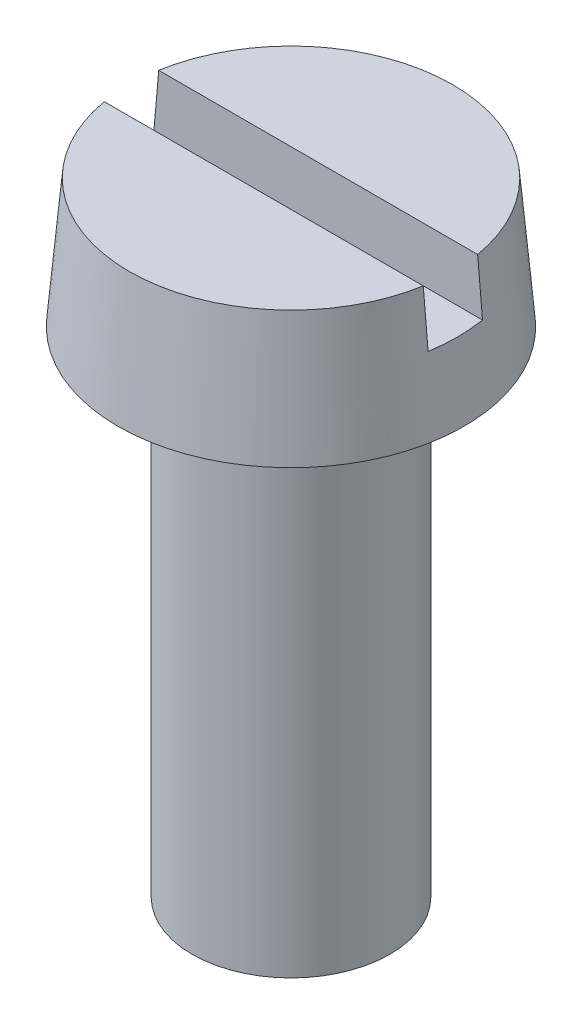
ISO-10303-21;
HEADER;
FILE_DESCRIPTION(('STEP AP214'),'2;1');
FILE_NAME('part.step','',(''),(''),'','','');
FILE_SCHEMA(('AUTOMOTIVE_DESIGN { 1 0 10303 214 1 1 1 1 }'));
ENDSEC;
DATA;
#1=APPLICATION_CONTEXT('core data for automotive mechanical design processes');
#2=APPLICATION_PROTOCOL_DEFINITION('international standard','automotive_design',2000,#1);
#3=PRODUCT_CONTEXT('',#1,'mechanical');
#4=PRODUCT('Part','Part','',(#3));
#5=PRODUCT_RELATED_PRODUCT_CATEGORY('part','',(#4));
#6=PRODUCT_DEFINITION_FORMATION('','',#4);
#7=PRODUCT_DEFINITION_CONTEXT('part definition',#1,'design');
#8=PRODUCT_DEFINITION('design','',#6,#7);
#9=PRODUCT_DEFINITION_SHAPE('','',#8);
#10=(LENGTH_UNIT() NAMED_UNIT(*) SI_UNIT(.MILLI.,.METRE.));
#11=(NAMED_UNIT(*) PLANE_ANGLE_UNIT() SI_UNIT($,.RADIAN.));
#12=(NAMED_UNIT(*) SI_UNIT($,.STERADIAN.) SOLID_ANGLE_UNIT());
#13=UNCERTAINTY_MEASURE_WITH_UNIT(LENGTH_MEASURE(1.E-05),#10,'distance_accuracy_value','');
#14=(GEOMETRIC_REPRESENTATION_CONTEXT(3) GLOBAL_UNCERTAINTY_ASSIGNED_CONTEXT((#13)) GLOBAL_UNIT_ASSIGNED_CONTEXT((#10,
#11,#12)) REPRESENTATION_CONTEXT('',''));
#15=CARTESIAN_POINT('',(0.,0.,0.));
#16=DIRECTION('',(0.,0.,1.));
#17=DIRECTION('',(1.,0.,0.));
#18=AXIS2_PLACEMENT_3D('',#15,#16,#17);
#19=CARTESIAN_POINT('',(4.19999999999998,1.5,0.550000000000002));
#20=DIRECTION('',(0.,-1.,0.));
#21=DIRECTION('',(1.,0.,0.));
#22=AXIS2_PLACEMENT_3D('',#19,#20,#21);
#23=PLANE('',#22);
#24=CARTESIAN_POINT('',(0.,1.50000000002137,0.));
#25=DIRECTION('',(0.,-1.,0.));
#26=DIRECTION('',(0.,0.,-1.));
#27=AXIS2_PLACEMENT_3D('',#24,#25,#26);
#28=CIRCLE('',#27,3.36876700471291);
#29=CARTESIAN_POINT('',(-3.32356602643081,1.50000000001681,0.550000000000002));
#30=VERTEX_POINT('',#29);
#31=CARTESIAN_POINT('',(-3.32356602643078,1.50000000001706,-0.550000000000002));
#32=VERTEX_POINT('',#31);
#33=EDGE_CURVE('E70',#30,#32,#28,.T.);
#34=ORIENTED_EDGE('',*,*,#33,.F.);
#35=DIRECTION('',(1.,0.,0.));
#36=VECTOR('',#35,1.);
#37=CARTESIAN_POINT('',(4.19999999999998,1.50000000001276,0.550000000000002));
#38=LINE('',#37,#36);
#39=CARTESIAN_POINT('',(3.32356602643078,1.50000000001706,0.550000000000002));
#40=VERTEX_POINT('',#39);
#41=EDGE_CURVE('E68',#30,#40,#38,.T.);
#42=ORIENTED_EDGE('',*,*,#41,.T.);
#43=CARTESIAN_POINT('',(0.,1.50000000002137,0.));
#44=DIRECTION('',(0.,-1.,0.));
#45=DIRECTION('',(0.,0.,-1.));
#46=AXIS2_PLACEMENT_3D('',#43,#44,#45);
#47=CIRCLE('',#46,3.36876700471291);
#48=CARTESIAN_POINT('',(3.3235660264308,1.50000000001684,-0.550000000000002));
#49=VERTEX_POINT('',#48);
#50=EDGE_CURVE('E19',#49,#40,#47,.T.);
#51=ORIENTED_EDGE('',*,*,#50,.F.);
#52=DIRECTION('',(-1.,0.,0.));
#53=VECTOR('',#52,1.);
#54=CARTESIAN_POINT('',(4.19999999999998,1.50000000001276,-0.550000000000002));
#55=LINE('',#54,#53);
#56=EDGE_CURVE('E63',#49,#32,#55,.T.);
#57=ORIENTED_EDGE('',*,*,#56,.T.);
#58=EDGE_LOOP('',(#34,#42,#51,#57));
#59=FACE_BOUND('',#58,.T.);
#60=ADVANCED_FACE('F16',(#59),#23,.F.);
#61=CARTESIAN_POINT('',(4.19999999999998,2.6,0.550000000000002));
#62=DIRECTION('',(0.,0.,1.));
#63=DIRECTION('',(1.,0.,0.));
#64=AXIS2_PLACEMENT_3D('',#61,#62,#63);
#65=PLANE('',#64);
#66=DIRECTION('',(1.,0.,0.));
#67=VECTOR('',#66,1.);
#68=CARTESIAN_POINT('',(0.,2.6,0.549999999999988));
#69=LINE('',#68,#67);
#70=CARTESIAN_POINT('',(-3.22598034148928,2.59999999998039,0.549999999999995));
#71=VERTEX_POINT('',#70);
#72=CARTESIAN_POINT('',(3.22598034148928,2.59999999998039,0.549999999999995));
#73=VERTEX_POINT('',#72);
#74=EDGE_CURVE('E72',#71,#73,#69,.T.);
#75=ORIENTED_EDGE('',*,*,#74,.T.);
#76=CARTESIAN_POINT('',(3.32356602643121,1.50000000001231,0.550000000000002));
#77=CARTESIAN_POINT('',(3.30730834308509,1.68333391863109,0.550000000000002));
#78=CARTESIAN_POINT('',(3.29104736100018,1.86666754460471,0.550000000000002));
#79=CARTESIAN_POINT('',(3.25851879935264,2.23333421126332,0.550000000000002));
#80=CARTESIAN_POINT('',(3.24225121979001,2.41666725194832,0.550000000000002));
#81=CARTESIAN_POINT('',(3.22598034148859,2.59999999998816,0.550000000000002));
#82=B_SPLINE_CURVE_WITH_KNOTS('',3,(#76,#77,#78,#79,#80,#81),.UNSPECIFIED.,.F.,.F.,(4,2,4),(0.,
0.55216006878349,1.10432013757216),.UNSPECIFIED.);
#83=EDGE_CURVE('E79',#40,#73,#82,.T.);
#84=ORIENTED_EDGE('',*,*,#83,.F.);
#85=ORIENTED_EDGE('',*,*,#41,.F.);
#86=CARTESIAN_POINT('',(-3.22598034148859,2.59999999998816,0.550000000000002));
#87=CARTESIAN_POINT('',(-3.24225121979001,2.41666725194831,0.550000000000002));
#88=CARTESIAN_POINT('',(-3.25851879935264,2.2333342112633,0.550000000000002));
#89=CARTESIAN_POINT('',(-3.29104736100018,1.86666754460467,0.550000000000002));
#90=CARTESIAN_POINT('',(-3.30730834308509,1.68333391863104,0.550000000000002));
#91=CARTESIAN_POINT('',(-3.32356602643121,1.50000000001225,0.550000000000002));
#92=B_SPLINE_CURVE_WITH_KNOTS('',3,(#86,#87,#88,#89,#90,#91),.UNSPECIFIED.,.F.,.F.,(4,2,4),(0.,
0.552160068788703,1.10432013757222),.UNSPECIFIED.);
#93=EDGE_CURVE('E110',#71,#30,#92,.T.);
#94=ORIENTED_EDGE('',*,*,#93,.F.);
#95=EDGE_LOOP('',(#75,#84,#85,#94));
#96=FACE_BOUND('',#95,.T.);
#97=ADVANCED_FACE('F119',(#96),#65,.F.);
#98=CARTESIAN_POINT('',(4.19999999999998,1.5,-0.550000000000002));
#99=DIRECTION('',(0.,0.,-1.));
#100=DIRECTION('',(-1.,0.,0.));
#101=AXIS2_PLACEMENT_3D('',#98,#99,#100);
#102=PLANE('',#101);
#103=CARTESIAN_POINT('',(3.22598034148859,2.59999999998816,-0.550000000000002));
#104=CARTESIAN_POINT('',(3.24225121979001,2.41666725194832,-0.550000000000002));
#105=CARTESIAN_POINT('',(3.25851879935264,2.23333421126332,-0.550000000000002));
#106=CARTESIAN_POINT('',(3.29104736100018,1.86666754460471,-0.550000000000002));
#107=CARTESIAN_POINT('',(3.30730834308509,1.68333391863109,-0.550000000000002));
#108=CARTESIAN_POINT('',(3.32356602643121,1.50000000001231,-0.550000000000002));
#109=B_SPLINE_CURVE_WITH_KNOTS('',3,(#103,#104,#105,#106,#107,#108),.UNSPECIFIED.,.F.,.F.,(4,2,
4),(0.,0.552160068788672,1.10432013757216),.UNSPECIFIED.);
#110=CARTESIAN_POINT('',(3.22598034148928,2.59999999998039,-0.550000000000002));
#111=VERTEX_POINT('',#110);
#112=EDGE_CURVE('E52',#111,#49,#109,.T.);
#113=ORIENTED_EDGE('',*,*,#112,.F.);
#114=DIRECTION('',(1.,0.,0.));
#115=VECTOR('',#114,1.);
#116=CARTESIAN_POINT('',(0.,2.6,-0.550000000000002));
#117=LINE('',#116,#115);
#118=CARTESIAN_POINT('',(-3.22598034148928,2.59999999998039,-0.550000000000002));
#119=VERTEX_POINT('',#118);
#120=EDGE_CURVE('E75',#111,#119,#117,.F.);
#121=ORIENTED_EDGE('',*,*,#120,.T.);
#122=CARTESIAN_POINT('',(-3.32356602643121,1.50000000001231,-0.550000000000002));
#123=CARTESIAN_POINT('',(-3.30730834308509,1.68333391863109,-0.550000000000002));
#124=CARTESIAN_POINT('',(-3.29104736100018,1.86666754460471,-0.550000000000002));
#125=CARTESIAN_POINT('',(-3.25851879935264,2.23333421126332,-0.550000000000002));
#126=CARTESIAN_POINT('',(-3.24225121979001,2.41666725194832,-0.550000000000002));
#127=CARTESIAN_POINT('',(-3.22598034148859,2.59999999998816,-0.550000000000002));
#128=B_SPLINE_CURVE_WITH_KNOTS('',3,(#122,#123,#124,#125,#126,#127),.UNSPECIFIED.,.F.,.F.,(4,2,
4),(0.,0.55216006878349,1.10432013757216),.UNSPECIFIED.);
#129=EDGE_CURVE('E34',#32,#119,#128,.T.);
#130=ORIENTED_EDGE('',*,*,#129,.F.);
#131=ORIENTED_EDGE('',*,*,#56,.F.);
#132=EDGE_LOOP('',(#113,#121,#130,#131));
#133=FACE_BOUND('',#132,.T.);
#134=ADVANCED_FACE('F71',(#133),#102,.F.);
#135=CARTESIAN_POINT('',(0.,2.6,0.));
#136=DIRECTION('',(0.,-1.,0.));
#137=DIRECTION('',(1.,0.,0.));
#138=AXIS2_PLACEMENT_3D('',#135,#136,#137);
#139=PLANE('',#138);
#140=CARTESIAN_POINT('',(0.,2.59999999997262,0.));
#141=DIRECTION('',(0.,-1.,0.));
#142=DIRECTION('',(0.,0.,-1.));
#143=AXIS2_PLACEMENT_3D('',#140,#141,#142);
#144=CIRCLE('',#143,3.27252947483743);
#145=EDGE_CURVE('E87',#73,#71,#144,.T.);
#146=ORIENTED_EDGE('',*,*,#145,.F.);
#147=ORIENTED_EDGE('',*,*,#74,.F.);
#148=EDGE_LOOP('',(#146,#147));
#149=FACE_BOUND('',#148,.T.);
#150=ADVANCED_FACE('F129',(#149),#139,.F.);
#151=CARTESIAN_POINT('',(0.,2.6,0.));
#152=DIRECTION('',(0.,-1.,0.));
#153=DIRECTION('',(1.,0.,0.));
#154=AXIS2_PLACEMENT_3D('',#151,#152,#153);
#155=PLANE('',#154);
#156=ORIENTED_EDGE('',*,*,#120,.F.);
#157=CARTESIAN_POINT('',(0.,2.59999999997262,0.));
#158=DIRECTION('',(0.,-1.,0.));
#159=DIRECTION('',(0.,0.,-1.));
#160=AXIS2_PLACEMENT_3D('',#157,#158,#159);
#161=CIRCLE('',#160,3.27252947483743);
#162=EDGE_CURVE('E59',#119,#111,#161,.T.);
#163=ORIENTED_EDGE('',*,*,#162,.F.);
#164=EDGE_LOOP('',(#156,#163));
#165=FACE_BOUND('',#164,.T.);
#166=ADVANCED_FACE('F106',(#165),#155,.F.);
#167=CARTESIAN_POINT('',(0.,1.13686837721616E-10,0.));
#168=DIRECTION('',(0.,-1.,0.));
#169=DIRECTION('',(0.,0.,-1.));
#170=AXIS2_PLACEMENT_3D('',#167,#168,#169);
#171=CONICAL_SURFACE('',#170,3.4999999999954,0.0872664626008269);
#172=ORIENTED_EDGE('',*,*,#83,.T.);
#173=ORIENTED_EDGE('',*,*,#145,.T.);
#174=ORIENTED_EDGE('',*,*,#93,.T.);
#175=ORIENTED_EDGE('',*,*,#33,.T.);
#176=ORIENTED_EDGE('',*,*,#129,.T.);
#177=ORIENTED_EDGE('',*,*,#162,.T.);
#178=ORIENTED_EDGE('',*,*,#112,.T.);
#179=ORIENTED_EDGE('',*,*,#50,.T.);
#180=EDGE_LOOP('',(#172,#173,#174,#175,#176,#177,#178,#179));
#181=FACE_BOUND('',#180,.T.);
#182=CARTESIAN_POINT('',(0.,0.,0.));
#183=DIRECTION('',(0.,-1.,0.));
#184=DIRECTION('',(0.,0.,-1.));
#185=AXIS2_PLACEMENT_3D('',#182,#183,#184);
#186=CIRCLE('',#185,3.50000000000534);
#187=CARTESIAN_POINT('',(0.,0.,-3.50000000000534));
#188=VERTEX_POINT('',#187);
#189=EDGE_CURVE('E83',#188,#188,#186,.T.);
#190=ORIENTED_EDGE('',*,*,#189,.F.);
#191=EDGE_LOOP('',(#190));
#192=FACE_BOUND('',#191,.T.);
#193=ADVANCED_FACE('F55',(#181,#192),#171,.T.);
#194=CARTESIAN_POINT('',(0.,0.,0.));
#195=DIRECTION('',(0.,-1.,0.));
#196=DIRECTION('',(1.,0.,0.));
#197=AXIS2_PLACEMENT_3D('',#194,#195,#196);
#198=PLANE('',#197);
#199=ORIENTED_EDGE('',*,*,#189,.T.);
#200=EDGE_LOOP('',(#199));
#201=FACE_BOUND('',#200,.T.);
#202=CARTESIAN_POINT('',(0.,0.,0.));
#203=DIRECTION('',(0.,-1.,0.));
#204=DIRECTION('',(1.,0.,0.));
#205=AXIS2_PLACEMENT_3D('',#202,#203,#204);
#206=CIRCLE('',#205,2.);
#207=CARTESIAN_POINT('',(2.,0.,0.));
#208=VERTEX_POINT('',#207);
#209=EDGE_CURVE('E25',#208,#208,#206,.T.);
#210=ORIENTED_EDGE('',*,*,#209,.F.);
#211=EDGE_LOOP('',(#210));
#212=FACE_BOUND('',#211,.T.);
#213=ADVANCED_FACE('F105',(#201,#212),#198,.T.);
#214=CARTESIAN_POINT('',(0.,-9.99999999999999,0.));
#215=DIRECTION('',(0.,-1.,0.));
#216=DIRECTION('',(1.,0.,0.));
#217=AXIS2_PLACEMENT_3D('',#214,#215,#216);
#218=PLANE('',#217);
#219=CARTESIAN_POINT('',(0.,-9.99999999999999,0.));
#220=DIRECTION('',(0.,-1.,0.));
#221=DIRECTION('',(1.,0.,0.));
#222=AXIS2_PLACEMENT_3D('',#219,#220,#221);
#223=CIRCLE('',#222,2.);
#224=CARTESIAN_POINT('',(2.,-9.99999999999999,0.));
#225=VERTEX_POINT('',#224);
#226=EDGE_CURVE('E11',#225,#225,#223,.F.);
#227=ORIENTED_EDGE('',*,*,#226,.F.);
#228=EDGE_LOOP('',(#227));
#229=FACE_BOUND('',#228,.T.);
#230=ADVANCED_FACE('F132',(#229),#218,.T.);
#231=CARTESIAN_POINT('',(0.,3.23,0.));
#232=DIRECTION('',(0.,-1.,0.));
#233=DIRECTION('',(1.,0.,0.));
#234=AXIS2_PLACEMENT_3D('',#231,#232,#233);
#235=CYLINDRICAL_SURFACE('',#234,2.);
#236=ORIENTED_EDGE('',*,*,#226,.T.);
#237=EDGE_LOOP('',(#236));
#238=FACE_BOUND('',#237,.T.);
#239=ORIENTED_EDGE('',*,*,#209,.T.);
#240=EDGE_LOOP('',(#239));
#241=FACE_BOUND('',#240,.T.);
#242=ADVANCED_FACE('F130',(#238,#241),#235,.T.);
#243=CLOSED_SHELL('',(#60,#97,#134,#150,#166,#193,#213,#230,#242));
#244=MANIFOLD_SOLID_BREP('B1',#243);
#245=ADVANCED_BREP_SHAPE_REPRESENTATION('',(#18,#244),#14);
#246=SHAPE_DEFINITION_REPRESENTATION(#9,#245);
ENDSEC;
END-ISO-10303-21;
